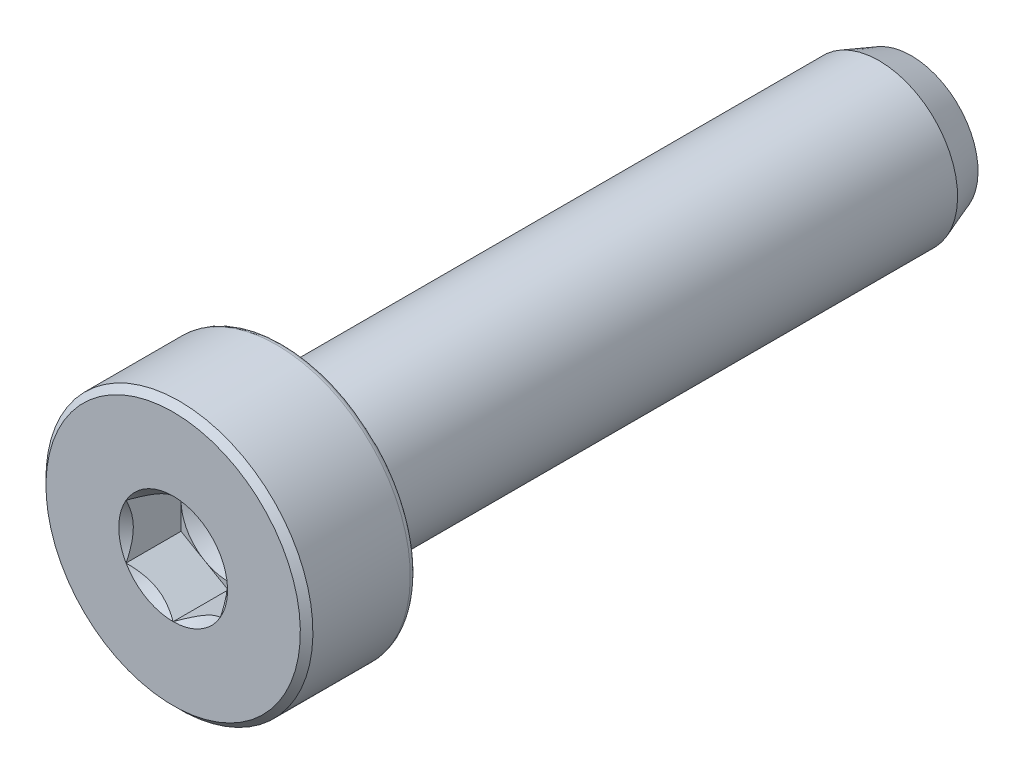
ISO-10303-21;
HEADER;
FILE_DESCRIPTION(('STEP AP214'),'2;1');
FILE_NAME('part.step','',(''),(''),'','','');
FILE_SCHEMA(('AUTOMOTIVE_DESIGN { 1 0 10303 214 1 1 1 1 }'));
ENDSEC;
DATA;
#1=APPLICATION_CONTEXT('core data for automotive mechanical design processes');
#2=APPLICATION_PROTOCOL_DEFINITION('international standard','automotive_design',2000,#1);
#3=PRODUCT_CONTEXT('',#1,'mechanical');
#4=PRODUCT('Part','Part','',(#3));
#5=PRODUCT_RELATED_PRODUCT_CATEGORY('part','',(#4));
#6=PRODUCT_DEFINITION_FORMATION('','',#4);
#7=PRODUCT_DEFINITION_CONTEXT('part definition',#1,'design');
#8=PRODUCT_DEFINITION('design','',#6,#7);
#9=PRODUCT_DEFINITION_SHAPE('','',#8);
#10=(LENGTH_UNIT() NAMED_UNIT(*) SI_UNIT(.MILLI.,.METRE.));
#11=(NAMED_UNIT(*) PLANE_ANGLE_UNIT() SI_UNIT($,.RADIAN.));
#12=(NAMED_UNIT(*) SI_UNIT($,.STERADIAN.) SOLID_ANGLE_UNIT());
#13=UNCERTAINTY_MEASURE_WITH_UNIT(LENGTH_MEASURE(1.E-05),#10,'distance_accuracy_value','');
#14=(GEOMETRIC_REPRESENTATION_CONTEXT(3) GLOBAL_UNCERTAINTY_ASSIGNED_CONTEXT((#13)) GLOBAL_UNIT_ASSIGNED_CONTEXT((#10,
#11,#12)) REPRESENTATION_CONTEXT('',''));
#15=CARTESIAN_POINT('',(0.,0.,0.));
#16=DIRECTION('',(0.,0.,1.));
#17=DIRECTION('',(1.,0.,0.));
#18=AXIS2_PLACEMENT_3D('',#15,#16,#17);
#19=CARTESIAN_POINT('',(-3.,0.,1.75));
#20=DIRECTION('',(0.,0.,-1.));
#21=DIRECTION('',(-1.,0.,0.));
#22=AXIS2_PLACEMENT_3D('',#19,#20,#21);
#23=PLANE('',#22);
#24=CARTESIAN_POINT('',(0.,0.,1.75));
#25=DIRECTION('',(0.,0.,1.));
#26=DIRECTION('',(1.,0.,0.));
#27=AXIS2_PLACEMENT_3D('',#24,#25,#26);
#28=CIRCLE('',#27,1.5);
#29=CARTESIAN_POINT('',(1.5,0.,1.75));
#30=VERTEX_POINT('',#29);
#31=CARTESIAN_POINT('',(0.750000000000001,1.29903810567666,1.75));
#32=VERTEX_POINT('',#31);
#33=EDGE_CURVE('E52',#30,#32,#28,.T.);
#34=ORIENTED_EDGE('',*,*,#33,.F.);
#35=DIRECTION('',(0.,1.,0.));
#36=VECTOR('',#35,1.);
#37=CARTESIAN_POINT('',(1.5,-0.866025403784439,1.75));
#38=LINE('',#37,#36);
#39=CARTESIAN_POINT('',(1.5,0.86602540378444,1.75));
#40=VERTEX_POINT('',#39);
#41=EDGE_CURVE('E122',#30,#40,#38,.T.);
#42=ORIENTED_EDGE('',*,*,#41,.T.);
#43=DIRECTION('',(-0.866025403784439,0.5,0.));
#44=VECTOR('',#43,1.);
#45=CARTESIAN_POINT('',(1.5,0.86602540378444,1.75));
#46=LINE('',#45,#44);
#47=EDGE_CURVE('E125',#40,#32,#46,.T.);
#48=ORIENTED_EDGE('',*,*,#47,.T.);
#49=EDGE_LOOP('',(#34,#42,#48));
#50=FACE_BOUND('',#49,.T.);
#51=ADVANCED_FACE('F36',(#50),#23,.F.);
#52=CARTESIAN_POINT('',(-0.750000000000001,1.29903810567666,1.75));
#53=VERTEX_POINT('',#52);
#54=EDGE_CURVE('E11',#32,#53,#28,.T.);
#55=ORIENTED_EDGE('',*,*,#54,.F.);
#56=CARTESIAN_POINT('',(0.,1.73205080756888,1.75));
#57=VERTEX_POINT('',#56);
#58=EDGE_CURVE('E139',#32,#57,#46,.T.);
#59=ORIENTED_EDGE('',*,*,#58,.T.);
#60=DIRECTION('',(-0.866025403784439,-0.5,0.));
#61=VECTOR('',#60,1.);
#62=CARTESIAN_POINT('',(0.,1.73205080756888,1.75));
#63=LINE('',#62,#61);
#64=EDGE_CURVE('E145',#57,#53,#63,.T.);
#65=ORIENTED_EDGE('',*,*,#64,.T.);
#66=EDGE_LOOP('',(#55,#59,#65));
#67=FACE_BOUND('',#66,.T.);
#68=ADVANCED_FACE('F299',(#67),#23,.F.);
#69=CARTESIAN_POINT('',(-1.5,0.,1.75));
#70=VERTEX_POINT('',#69);
#71=EDGE_CURVE('E50',#53,#70,#28,.T.);
#72=ORIENTED_EDGE('',*,*,#71,.F.);
#73=CARTESIAN_POINT('',(-1.5,0.866025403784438,1.75));
#74=VERTEX_POINT('',#73);
#75=EDGE_CURVE('E144',#53,#74,#63,.T.);
#76=ORIENTED_EDGE('',*,*,#75,.T.);
#77=DIRECTION('',(0.,-1.,0.));
#78=VECTOR('',#77,1.);
#79=CARTESIAN_POINT('',(-1.5,0.866025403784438,1.75));
#80=LINE('',#79,#78);
#81=EDGE_CURVE('E149',#74,#70,#80,.T.);
#82=ORIENTED_EDGE('',*,*,#81,.T.);
#83=EDGE_LOOP('',(#72,#76,#82));
#84=FACE_BOUND('',#83,.T.);
#85=ADVANCED_FACE('F303',(#84),#23,.F.);
#86=CARTESIAN_POINT('',(-0.750000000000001,-1.29903810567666,1.75));
#87=VERTEX_POINT('',#86);
#88=EDGE_CURVE('E320',#70,#87,#28,.T.);
#89=ORIENTED_EDGE('',*,*,#88,.F.);
#90=CARTESIAN_POINT('',(-1.5,-0.866025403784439,1.75));
#91=VERTEX_POINT('',#90);
#92=EDGE_CURVE('E148',#70,#91,#80,.T.);
#93=ORIENTED_EDGE('',*,*,#92,.T.);
#94=DIRECTION('',(0.866025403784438,-0.5,0.));
#95=VECTOR('',#94,1.);
#96=CARTESIAN_POINT('',(-1.5,-0.866025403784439,1.75));
#97=LINE('',#96,#95);
#98=EDGE_CURVE('E245',#91,#87,#97,.T.);
#99=ORIENTED_EDGE('',*,*,#98,.T.);
#100=EDGE_LOOP('',(#89,#93,#99));
#101=FACE_BOUND('',#100,.T.);
#102=ADVANCED_FACE('F314',(#101),#23,.F.);
#103=CARTESIAN_POINT('',(0.75,-1.29903810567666,1.75));
#104=VERTEX_POINT('',#103);
#105=EDGE_CURVE('E59',#87,#104,#28,.T.);
#106=ORIENTED_EDGE('',*,*,#105,.F.);
#107=CARTESIAN_POINT('',(0.,-1.73205080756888,1.75));
#108=VERTEX_POINT('',#107);
#109=EDGE_CURVE('E229',#87,#108,#97,.T.);
#110=ORIENTED_EDGE('',*,*,#109,.T.);
#111=DIRECTION('',(0.866025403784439,0.5,0.));
#112=VECTOR('',#111,1.);
#113=CARTESIAN_POINT('',(0.,-1.73205080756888,1.75));
#114=LINE('',#113,#112);
#115=EDGE_CURVE('E134',#108,#104,#114,.T.);
#116=ORIENTED_EDGE('',*,*,#115,.T.);
#117=EDGE_LOOP('',(#106,#110,#116));
#118=FACE_BOUND('',#117,.T.);
#119=ADVANCED_FACE('F307',(#118),#23,.F.);
#120=EDGE_CURVE('E112',#104,#30,#28,.T.);
#121=ORIENTED_EDGE('',*,*,#120,.F.);
#122=CARTESIAN_POINT('',(1.5,-0.866025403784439,1.75));
#123=VERTEX_POINT('',#122);
#124=EDGE_CURVE('E137',#104,#123,#114,.T.);
#125=ORIENTED_EDGE('',*,*,#124,.T.);
#126=EDGE_CURVE('E130',#123,#30,#38,.T.);
#127=ORIENTED_EDGE('',*,*,#126,.T.);
#128=EDGE_LOOP('',(#121,#125,#127));
#129=FACE_BOUND('',#128,.T.);
#130=ADVANCED_FACE('F136',(#129),#23,.F.);
#131=CARTESIAN_POINT('',(0.,0.,0.));
#132=DIRECTION('',(0.,0.,1.));
#133=DIRECTION('',(1.,0.,0.));
#134=AXIS2_PLACEMENT_3D('',#131,#132,#133);
#135=PLANE('',#134);
#136=CARTESIAN_POINT('',(0.,0.,0.));
#137=DIRECTION('',(0.,0.,1.));
#138=DIRECTION('',(1.,0.,0.));
#139=AXIS2_PLACEMENT_3D('',#136,#137,#138);
#140=CIRCLE('',#139,2.5);
#141=CARTESIAN_POINT('',(2.5,0.,0.));
#142=VERTEX_POINT('',#141);
#143=EDGE_CURVE('E179',#142,#142,#140,.F.);
#144=ORIENTED_EDGE('',*,*,#143,.F.);
#145=EDGE_LOOP('',(#144));
#146=FACE_BOUND('',#145,.T.);
#147=CARTESIAN_POINT('',(0.,0.,0.));
#148=DIRECTION('',(0.,0.,-1.));
#149=DIRECTION('',(0.,1.,0.));
#150=AXIS2_PLACEMENT_3D('',#147,#148,#149);
#151=CIRCLE('',#150,4.05);
#152=CARTESIAN_POINT('',(0.,4.05,0.));
#153=VERTEX_POINT('',#152);
#154=EDGE_CURVE('E176',#153,#153,#151,.T.);
#155=ORIENTED_EDGE('',*,*,#154,.T.);
#156=EDGE_LOOP('',(#155));
#157=FACE_BOUND('',#156,.T.);
#158=ADVANCED_FACE('F306',(#146,#157),#135,.F.);
#159=CARTESIAN_POINT('',(0.,0.,0.));
#160=DIRECTION('',(0.,0.,-1.));
#161=DIRECTION('',(0.,1.,0.));
#162=AXIS2_PLACEMENT_3D('',#159,#160,#161);
#163=CYLINDRICAL_SURFACE('',#162,2.5);
#164=CARTESIAN_POINT('',(0.,0.,-18.9771755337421));
#165=DIRECTION('',(0.,0.,-1.));
#166=DIRECTION('',(0.,1.,0.));
#167=AXIS2_PLACEMENT_3D('',#164,#165,#166);
#168=CIRCLE('',#167,2.5);
#169=CARTESIAN_POINT('',(0.,2.5,-18.9771755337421));
#170=VERTEX_POINT('',#169);
#171=EDGE_CURVE('E184',#170,#170,#168,.T.);
#172=ORIENTED_EDGE('',*,*,#171,.F.);
#173=EDGE_LOOP('',(#172));
#174=FACE_BOUND('',#173,.T.);
#175=ORIENTED_EDGE('',*,*,#143,.T.);
#176=EDGE_LOOP('',(#175));
#177=FACE_BOUND('',#176,.T.);
#178=ADVANCED_FACE('F38',(#174,#177),#163,.T.);
#179=CARTESIAN_POINT('',(0.,0.,-18.9771755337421));
#180=DIRECTION('',(0.,0.,1.));
#181=DIRECTION('',(0.,-1.,0.));
#182=AXIS2_PLACEMENT_3D('',#179,#180,#181);
#183=CONICAL_SURFACE('',#182,2.5,0.349065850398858);
#184=CARTESIAN_POINT('',(0.,0.,-20.));
#185=DIRECTION('',(0.,0.,-1.));
#186=DIRECTION('',(0.,1.,0.));
#187=AXIS2_PLACEMENT_3D('',#184,#185,#186);
#188=CIRCLE('',#187,2.12772233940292);
#189=CARTESIAN_POINT('',(0.,2.12772233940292,-20.));
#190=VERTEX_POINT('',#189);
#191=EDGE_CURVE('E182',#190,#190,#188,.T.);
#192=ORIENTED_EDGE('',*,*,#191,.F.);
#193=EDGE_LOOP('',(#192));
#194=FACE_BOUND('',#193,.T.);
#195=ORIENTED_EDGE('',*,*,#171,.T.);
#196=EDGE_LOOP('',(#195));
#197=FACE_BOUND('',#196,.T.);
#198=ADVANCED_FACE('F354',(#194,#197),#183,.T.);
#199=CARTESIAN_POINT('',(0.,0.,-20.));
#200=DIRECTION('',(0.,0.,-1.));
#201=DIRECTION('',(0.,1.,0.));
#202=AXIS2_PLACEMENT_3D('',#199,#200,#201);
#203=PLANE('',#202);
#204=ORIENTED_EDGE('',*,*,#191,.T.);
#205=EDGE_LOOP('',(#204));
#206=FACE_BOUND('',#205,.T.);
#207=ADVANCED_FACE('F356',(#206),#203,.T.);
#208=CARTESIAN_POINT('',(0.,0.,0.199999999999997));
#209=DIRECTION('',(0.,0.,-1.));
#210=DIRECTION('',(0.,1.,0.));
#211=AXIS2_PLACEMENT_3D('',#208,#209,#210);
#212=TOROIDAL_SURFACE('',#211,4.05,0.199999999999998);
#213=ORIENTED_EDGE('',*,*,#154,.F.);
#214=EDGE_LOOP('',(#213));
#215=FACE_BOUND('',#214,.T.);
#216=CARTESIAN_POINT('',(0.,0.,0.199999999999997));
#217=DIRECTION('',(0.,0.,-1.));
#218=DIRECTION('',(0.,1.,0.));
#219=AXIS2_PLACEMENT_3D('',#216,#217,#218);
#220=CIRCLE('',#219,4.25);
#221=CARTESIAN_POINT('',(0.,4.25,0.199999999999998));
#222=VERTEX_POINT('',#221);
#223=EDGE_CURVE('E173',#222,#222,#220,.T.);
#224=ORIENTED_EDGE('',*,*,#223,.T.);
#225=EDGE_LOOP('',(#224));
#226=FACE_BOUND('',#225,.T.);
#227=ADVANCED_FACE('F349',(#215,#226),#212,.T.);
#228=CARTESIAN_POINT('',(0.,0.,3.5));
#229=DIRECTION('',(0.,0.,-1.));
#230=DIRECTION('',(-1.,0.,0.));
#231=AXIS2_PLACEMENT_3D('',#228,#229,#230);
#232=CYLINDRICAL_SURFACE('',#231,4.25);
#233=CARTESIAN_POINT('',(0.,0.,3.3));
#234=DIRECTION('',(0.,0.,-1.));
#235=DIRECTION('',(0.,1.,0.));
#236=AXIS2_PLACEMENT_3D('',#233,#234,#235);
#237=CIRCLE('',#236,4.25);
#238=CARTESIAN_POINT('',(0.,4.25,3.3));
#239=VERTEX_POINT('',#238);
#240=EDGE_CURVE('E170',#239,#239,#237,.T.);
#241=ORIENTED_EDGE('',*,*,#240,.T.);
#242=EDGE_LOOP('',(#241));
#243=FACE_BOUND('',#242,.T.);
#244=ORIENTED_EDGE('',*,*,#223,.F.);
#245=EDGE_LOOP('',(#244));
#246=FACE_BOUND('',#245,.T.);
#247=ADVANCED_FACE('F346',(#243,#246),#232,.T.);
#248=CARTESIAN_POINT('',(0.,0.,3.5));
#249=DIRECTION('',(0.,0.,-1.));
#250=DIRECTION('',(0.,1.,0.));
#251=AXIS2_PLACEMENT_3D('',#248,#249,#250);
#252=CONICAL_SURFACE('',#251,4.05,0.785398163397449);
#253=ORIENTED_EDGE('',*,*,#240,.F.);
#254=EDGE_LOOP('',(#253));
#255=FACE_BOUND('',#254,.T.);
#256=CARTESIAN_POINT('',(0.,0.,3.5));
#257=DIRECTION('',(0.,0.,-1.));
#258=DIRECTION('',(0.,1.,0.));
#259=AXIS2_PLACEMENT_3D('',#256,#257,#258);
#260=CIRCLE('',#259,4.05);
#261=CARTESIAN_POINT('',(0.,4.05,3.5));
#262=VERTEX_POINT('',#261);
#263=EDGE_CURVE('E156',#262,#262,#260,.T.);
#264=ORIENTED_EDGE('',*,*,#263,.T.);
#265=EDGE_LOOP('',(#264));
#266=FACE_BOUND('',#265,.T.);
#267=ADVANCED_FACE('F341',(#255,#266),#252,.T.);
#268=CARTESIAN_POINT('',(0.,0.,3.5));
#269=DIRECTION('',(0.,0.,1.));
#270=DIRECTION('',(1.,0.,0.));
#271=AXIS2_PLACEMENT_3D('',#268,#269,#270);
#272=PLANE('',#271);
#273=CARTESIAN_POINT('',(0.,0.,3.5));
#274=DIRECTION('',(0.,0.,1.));
#275=DIRECTION('',(1.,0.,0.));
#276=AXIS2_PLACEMENT_3D('',#273,#274,#275);
#277=CIRCLE('',#276,1.73205080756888);
#278=CARTESIAN_POINT('',(1.5,0.866025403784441,3.5));
#279=VERTEX_POINT('',#278);
#280=CARTESIAN_POINT('',(0.,1.73205080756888,3.5));
#281=VERTEX_POINT('',#280);
#282=EDGE_CURVE('E212',#279,#281,#277,.T.);
#283=ORIENTED_EDGE('',*,*,#282,.F.);
#284=CARTESIAN_POINT('',(1.5,-0.866025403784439,3.5));
#285=VERTEX_POINT('',#284);
#286=EDGE_CURVE('E205',#285,#279,#277,.T.);
#287=ORIENTED_EDGE('',*,*,#286,.F.);
#288=CARTESIAN_POINT('',(0.,-1.73205080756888,3.5));
#289=VERTEX_POINT('',#288);
#290=EDGE_CURVE('E198',#289,#285,#277,.T.);
#291=ORIENTED_EDGE('',*,*,#290,.F.);
#292=CARTESIAN_POINT('',(-1.5,-0.866025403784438,3.5));
#293=VERTEX_POINT('',#292);
#294=EDGE_CURVE('E204',#293,#289,#277,.T.);
#295=ORIENTED_EDGE('',*,*,#294,.F.);
#296=CARTESIAN_POINT('',(-1.5,0.866025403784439,3.5));
#297=VERTEX_POINT('',#296);
#298=EDGE_CURVE('E66',#297,#293,#277,.T.);
#299=ORIENTED_EDGE('',*,*,#298,.F.);
#300=EDGE_CURVE('E220',#281,#297,#277,.T.);
#301=ORIENTED_EDGE('',*,*,#300,.F.);
#302=EDGE_LOOP('',(#283,#287,#291,#295,#299,#301));
#303=FACE_BOUND('',#302,.T.);
#304=ORIENTED_EDGE('',*,*,#263,.F.);
#305=EDGE_LOOP('',(#304));
#306=FACE_BOUND('',#305,.T.);
#307=ADVANCED_FACE('F215',(#303,#306),#272,.T.);
#308=CARTESIAN_POINT('',(0.,0.,3.5));
#309=DIRECTION('',(0.,0.,1.));
#310=DIRECTION('',(1.,0.,0.));
#311=AXIS2_PLACEMENT_3D('',#308,#309,#310);
#312=CONICAL_SURFACE('',#311,1.73205080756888,0.78539816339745);
#313=ORIENTED_EDGE('',*,*,#290,.T.);
#314=CARTESIAN_POINT('',(-0.000200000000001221,-1.73216627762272,3.50011548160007));
#315=CARTESIAN_POINT('',(0.0513677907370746,-1.70239359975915,3.47036547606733));
#316=CARTESIAN_POINT('',(0.1037979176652,-1.67212305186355,3.44236248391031));
#317=CARTESIAN_POINT('',(0.210709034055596,-1.61039789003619,3.39108923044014));
#318=CARTESIAN_POINT('',(0.26520019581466,-1.57893740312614,3.36784750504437));
#319=CARTESIAN_POINT('',(0.375079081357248,-1.51549879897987,3.32803372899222));
#320=CARTESIAN_POINT('',(0.430438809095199,-1.4835368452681,3.3113615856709));
#321=CARTESIAN_POINT('',(0.54237725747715,-1.41890915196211,3.2856744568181));
#322=CARTESIAN_POINT('',(0.598952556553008,-1.38624538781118,3.27664029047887));
#323=CARTESIAN_POINT('',(0.69645538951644,-1.32995210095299,3.26848908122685));
#324=CARTESIAN_POINT('',(0.737256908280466,-1.30639533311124,3.26728225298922));
#325=CARTESIAN_POINT('',(0.818787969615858,-1.25932335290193,3.26931405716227));
#326=CARTESIAN_POINT('',(0.85951749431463,-1.23580815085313,3.27255367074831));
#327=CARTESIAN_POINT('',(0.940584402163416,-1.18900414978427,3.28329198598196));
#328=CARTESIAN_POINT('',(0.980921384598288,-1.1657155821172,3.29079465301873));
#329=CARTESIAN_POINT('',(1.06091833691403,-1.11952932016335,3.30965161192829));
#330=CARTESIAN_POINT('',(1.10057800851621,-1.09663179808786,3.32100755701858));
#331=CARTESIAN_POINT('',(1.20216313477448,-1.03798159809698,3.35472164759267));
#332=CARTESIAN_POINT('',(1.26345855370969,-1.00259267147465,3.37962184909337));
#333=CARTESIAN_POINT('',(1.35358562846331,-0.950557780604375,3.42165665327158));
#334=CARTESIAN_POINT('',(1.38328513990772,-0.933410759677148,3.4364251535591));
#335=CARTESIAN_POINT('',(1.44213790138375,-0.899432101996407,3.46731056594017));
#336=CARTESIAN_POINT('',(1.47129140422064,-0.88260031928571,3.48342683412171));
#337=CARTESIAN_POINT('',(1.5002,-0.865909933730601,3.50011548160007));
#338=B_SPLINE_CURVE_WITH_KNOTS('',3,(#314,#315,#316,#317,#318,#319,#320,#321,#322,#323,#324,
#325,#326,#327,#328,#329,#330,#331,#332,#333,#334,#335,#336,#337),.UNSPECIFIED.,.F.,.F.,(4,2,2,
2,2,2,2,2,2,2,2,4),(0.,0.199829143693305,0.400822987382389,0.598623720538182,0.79592624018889,
0.937113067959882,1.07833105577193,1.21968061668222,1.36109089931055,1.58570969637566,
1.69770705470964,1.80965120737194),.UNSPECIFIED.);
#339=EDGE_CURVE('E40',#289,#285,#338,.T.);
#340=ORIENTED_EDGE('',*,*,#339,.F.);
#341=EDGE_LOOP('',(#313,#340));
#342=FACE_BOUND('',#341,.T.);
#343=ADVANCED_FACE('F200',(#342),#312,.F.);
#344=ORIENTED_EDGE('',*,*,#286,.T.);
#345=CARTESIAN_POINT('',(1.5,-1.72720812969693,4.05557851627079));
#346=CARTESIAN_POINT('',(1.5,-1.68515175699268,4.02382990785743));
#347=CARTESIAN_POINT('',(1.5,-1.64286104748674,3.99239259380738));
#348=CARTESIAN_POINT('',(1.5,-1.55771581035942,3.93026908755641));
#349=CARTESIAN_POINT('',(1.5,-1.51486114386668,3.8995830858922));
#350=CARTESIAN_POINT('',(1.5,-1.3846813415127,3.80840719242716));
#351=CARTESIAN_POINT('',(1.5,-1.29637976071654,3.74928834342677));
#352=CARTESIAN_POINT('',(1.5,-1.11121478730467,3.6332309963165));
#353=CARTESIAN_POINT('',(1.5,-1.01415038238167,3.57660955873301));
#354=CARTESIAN_POINT('',(1.5,-0.815173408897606,3.47303688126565));
#355=CARTESIAN_POINT('',(1.5,-0.713278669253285,3.42605304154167));
#356=CARTESIAN_POINT('',(1.5,-0.560333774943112,3.36857266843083));
#357=CARTESIAN_POINT('',(1.5,-0.511547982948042,3.35207538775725));
#358=CARTESIAN_POINT('',(1.5,-0.412798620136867,3.322997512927));
#359=CARTESIAN_POINT('',(1.5,-0.362834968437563,3.31041718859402));
#360=CARTESIAN_POINT('',(1.5,-0.262863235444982,3.29003619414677));
#361=CARTESIAN_POINT('',(1.5,-0.212872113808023,3.28215363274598));
#362=CARTESIAN_POINT('',(1.5,-0.112355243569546,3.271322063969));
#363=CARTESIAN_POINT('',(1.5,-0.0618295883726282,3.26837220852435));
#364=CARTESIAN_POINT('',(1.5,0.0374291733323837,3.26762485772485));
#365=CARTESIAN_POINT('',(1.5,0.0861609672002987,3.26964473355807));
#366=CARTESIAN_POINT('',(1.5,0.183206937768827,3.27832255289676));
#367=CARTESIAN_POINT('',(1.5,0.231521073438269,3.28498094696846));
#368=CARTESIAN_POINT('',(1.5,0.328199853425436,3.30268524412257));
#369=CARTESIAN_POINT('',(1.5,0.376550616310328,3.31380581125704));
#370=CARTESIAN_POINT('',(1.5,0.472195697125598,3.33984341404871));
#371=CARTESIAN_POINT('',(1.5,0.51949010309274,3.35476013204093));
#372=CARTESIAN_POINT('',(1.5,0.668391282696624,3.40733522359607));
#373=CARTESIAN_POINT('',(1.5,0.767878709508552,3.45098128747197));
#374=CARTESIAN_POINT('',(1.5,0.962179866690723,3.5480229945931));
#375=CARTESIAN_POINT('',(1.5,1.05697519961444,3.60145366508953));
#376=CARTESIAN_POINT('',(1.5,1.23814273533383,3.71168585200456));
#377=CARTESIAN_POINT('',(1.5,1.3246994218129,3.76818792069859));
#378=CARTESIAN_POINT('',(1.5,1.45222331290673,3.85553430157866));
#379=CARTESIAN_POINT('',(1.5,1.49418091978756,3.88495775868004));
#380=CARTESIAN_POINT('',(1.5,1.57752272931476,3.94458282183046));
#381=CARTESIAN_POINT('',(1.5,1.61890708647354,3.97478421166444));
#382=CARTESIAN_POINT('',(1.5,1.66005278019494,4.00530817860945));
#383=B_SPLINE_CURVE_WITH_KNOTS('',3,(#345,#346,#347,#348,#349,#350,#351,#352,#353,#354,#355,
#356,#357,#358,#359,#360,#361,#362,#363,#364,#365,#366,#367,#368,#369,#370,#371,#372,#373,#374,
#375,#376,#377,#378,#379,#380,#381,#382),.UNSPECIFIED.,.F.,.F.,(4,2,2,2,2,2,2,2,2,2,2,2,2,2,2,2,
2,2,4),(0.,0.158079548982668,0.316198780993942,0.634850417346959,0.971690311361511,
1.30737131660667,1.46173961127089,1.61611853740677,1.7677210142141,1.91929742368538,
2.065387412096,2.21149159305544,2.36014984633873,2.5087956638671,2.83376031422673,
3.15991186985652,3.46985601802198,3.62358896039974,3.7772796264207),.UNSPECIFIED.);
#384=EDGE_CURVE('E208',#285,#279,#383,.T.);
#385=ORIENTED_EDGE('',*,*,#384,.F.);
#386=EDGE_LOOP('',(#344,#385));
#387=FACE_BOUND('',#386,.T.);
#388=ADVANCED_FACE('F209',(#387),#312,.F.);
#389=ORIENTED_EDGE('',*,*,#282,.T.);
#390=CARTESIAN_POINT('',(1.5002,0.865909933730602,3.50011548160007));
#391=CARTESIAN_POINT('',(1.44863220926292,0.895682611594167,3.47036547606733));
#392=CARTESIAN_POINT('',(1.3962020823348,0.925953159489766,3.44236248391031));
#393=CARTESIAN_POINT('',(1.2892909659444,0.987678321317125,3.39108923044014));
#394=CARTESIAN_POINT('',(1.23479980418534,1.01913880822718,3.36784750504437));
#395=CARTESIAN_POINT('',(1.12492091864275,1.08257741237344,3.32803372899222));
#396=CARTESIAN_POINT('',(1.0695611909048,1.11453936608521,3.3113615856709));
#397=CARTESIAN_POINT('',(0.95762274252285,1.1791670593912,3.2856744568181));
#398=CARTESIAN_POINT('',(0.901047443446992,1.21183082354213,3.27664029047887));
#399=CARTESIAN_POINT('',(0.80354461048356,1.26812411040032,3.26848908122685));
#400=CARTESIAN_POINT('',(0.762743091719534,1.29168087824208,3.26728225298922));
#401=CARTESIAN_POINT('',(0.681212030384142,1.33875285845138,3.26931405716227));
#402=CARTESIAN_POINT('',(0.64048250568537,1.36226806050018,3.27255367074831));
#403=CARTESIAN_POINT('',(0.559415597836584,1.40907206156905,3.28329198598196));
#404=CARTESIAN_POINT('',(0.519078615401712,1.43236062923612,3.29079465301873));
#405=CARTESIAN_POINT('',(0.439081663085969,1.47854689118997,3.30965161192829));
#406=CARTESIAN_POINT('',(0.399421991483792,1.50144441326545,3.32100755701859));
#407=CARTESIAN_POINT('',(0.297836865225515,1.56009461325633,3.35472164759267));
#408=CARTESIAN_POINT('',(0.236541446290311,1.59548353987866,3.37962184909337));
#409=CARTESIAN_POINT('',(0.146414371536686,1.64751843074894,3.42165665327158));
#410=CARTESIAN_POINT('',(0.116714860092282,1.66466545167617,3.4364251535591));
#411=CARTESIAN_POINT('',(0.0578620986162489,1.69864410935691,3.46731056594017));
#412=CARTESIAN_POINT('',(0.0287085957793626,1.71547589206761,3.48342683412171));
#413=CARTESIAN_POINT('',(-0.000200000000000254,1.73216627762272,3.50011548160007));
#414=B_SPLINE_CURVE_WITH_KNOTS('',3,(#390,#391,#392,#393,#394,#395,#396,#397,#398,#399,#400,
#401,#402,#403,#404,#405,#406,#407,#408,#409,#410,#411,#412,#413),.UNSPECIFIED.,.F.,.F.,(4,2,2,
2,2,2,2,2,2,2,2,4),(0.,0.199829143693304,0.400822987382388,0.598623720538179,0.795926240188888,
0.93711306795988,1.07833105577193,1.21968061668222,1.36109089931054,1.58570969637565,
1.69770705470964,1.80965120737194),.UNSPECIFIED.);
#415=EDGE_CURVE('E211',#279,#281,#414,.T.);
#416=ORIENTED_EDGE('',*,*,#415,.F.);
#417=EDGE_LOOP('',(#389,#416));
#418=FACE_BOUND('',#417,.T.);
#419=ADVANCED_FACE('F329',(#418),#312,.F.);
#420=ORIENTED_EDGE('',*,*,#300,.T.);
#421=CARTESIAN_POINT('',(0.000200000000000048,1.73216627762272,3.50011548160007));
#422=CARTESIAN_POINT('',(-0.0513677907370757,1.70239359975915,3.47036547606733));
#423=CARTESIAN_POINT('',(-0.103797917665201,1.67212305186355,3.44236248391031));
#424=CARTESIAN_POINT('',(-0.210709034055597,1.61039789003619,3.39108923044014));
#425=CARTESIAN_POINT('',(-0.265200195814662,1.57893740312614,3.36784750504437));
#426=CARTESIAN_POINT('',(-0.375079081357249,1.51549879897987,3.32803372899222));
#427=CARTESIAN_POINT('',(-0.4304388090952,1.4835368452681,3.3113615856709));
#428=CARTESIAN_POINT('',(-0.542377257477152,1.41890915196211,3.2856744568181));
#429=CARTESIAN_POINT('',(-0.59895255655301,1.38624538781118,3.27664029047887));
#430=CARTESIAN_POINT('',(-0.696455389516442,1.32995210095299,3.26848908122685));
#431=CARTESIAN_POINT('',(-0.737256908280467,1.30639533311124,3.26728225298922));
#432=CARTESIAN_POINT('',(-0.818787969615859,1.25932335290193,3.26931405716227));
#433=CARTESIAN_POINT('',(-0.859517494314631,1.23580815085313,3.27255367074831));
#434=CARTESIAN_POINT('',(-0.940584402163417,1.18900414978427,3.28329198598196));
#435=CARTESIAN_POINT('',(-0.980921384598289,1.1657155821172,3.29079465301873));
#436=CARTESIAN_POINT('',(-1.06091833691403,1.11952932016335,3.30965161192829));
#437=CARTESIAN_POINT('',(-1.10057800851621,1.09663179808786,3.32100755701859));
#438=CARTESIAN_POINT('',(-1.20216313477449,1.03798159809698,3.35472164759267));
#439=CARTESIAN_POINT('',(-1.26345855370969,1.00259267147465,3.37962184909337));
#440=CARTESIAN_POINT('',(-1.35358562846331,0.950557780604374,3.42165665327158));
#441=CARTESIAN_POINT('',(-1.38328513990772,0.933410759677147,3.4364251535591));
#442=CARTESIAN_POINT('',(-1.44213790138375,0.899432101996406,3.46731056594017));
#443=CARTESIAN_POINT('',(-1.47129140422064,0.88260031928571,3.48342683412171));
#444=CARTESIAN_POINT('',(-1.5002,0.865909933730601,3.50011548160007));
#445=B_SPLINE_CURVE_WITH_KNOTS('',3,(#421,#422,#423,#424,#425,#426,#427,#428,#429,#430,#431,
#432,#433,#434,#435,#436,#437,#438,#439,#440,#441,#442,#443,#444),.UNSPECIFIED.,.F.,.F.,(4,2,2,
2,2,2,2,2,2,2,2,4),(0.,0.199829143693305,0.40082298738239,0.598623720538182,0.795926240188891,
0.937113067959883,1.07833105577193,1.21968061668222,1.36109089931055,1.58570969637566,
1.69770705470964,1.80965120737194),.UNSPECIFIED.);
#446=EDGE_CURVE('E240',#281,#297,#445,.T.);
#447=ORIENTED_EDGE('',*,*,#446,.F.);
#448=EDGE_LOOP('',(#420,#447));
#449=FACE_BOUND('',#448,.T.);
#450=ADVANCED_FACE('F327',(#449),#312,.F.);
#451=ORIENTED_EDGE('',*,*,#298,.T.);
#452=CARTESIAN_POINT('',(-1.5,-1.72720812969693,4.05557851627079));
#453=CARTESIAN_POINT('',(-1.5,-1.68515175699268,4.02382990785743));
#454=CARTESIAN_POINT('',(-1.5,-1.64286104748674,3.99239259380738));
#455=CARTESIAN_POINT('',(-1.5,-1.55771581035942,3.93026908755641));
#456=CARTESIAN_POINT('',(-1.5,-1.51486114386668,3.8995830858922));
#457=CARTESIAN_POINT('',(-1.5,-1.3846813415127,3.80840719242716));
#458=CARTESIAN_POINT('',(-1.5,-1.29637976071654,3.74928834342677));
#459=CARTESIAN_POINT('',(-1.5,-1.11121478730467,3.6332309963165));
#460=CARTESIAN_POINT('',(-1.5,-1.01415038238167,3.57660955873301));
#461=CARTESIAN_POINT('',(-1.5,-0.815173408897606,3.47303688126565));
#462=CARTESIAN_POINT('',(-1.5,-0.713278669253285,3.42605304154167));
#463=CARTESIAN_POINT('',(-1.5,-0.560333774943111,3.36857266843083));
#464=CARTESIAN_POINT('',(-1.5,-0.511547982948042,3.35207538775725));
#465=CARTESIAN_POINT('',(-1.5,-0.412798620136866,3.322997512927));
#466=CARTESIAN_POINT('',(-1.5,-0.362834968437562,3.31041718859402));
#467=CARTESIAN_POINT('',(-1.5,-0.262863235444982,3.29003619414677));
#468=CARTESIAN_POINT('',(-1.5,-0.212872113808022,3.28215363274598));
#469=CARTESIAN_POINT('',(-1.5,-0.112355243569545,3.271322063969));
#470=CARTESIAN_POINT('',(-1.5,-0.0618295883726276,3.26837220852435));
#471=CARTESIAN_POINT('',(-1.5,0.0374291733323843,3.26762485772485));
#472=CARTESIAN_POINT('',(-1.5,0.0861609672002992,3.26964473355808));
#473=CARTESIAN_POINT('',(-1.5,0.183206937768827,3.27832255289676));
#474=CARTESIAN_POINT('',(-1.5,0.231521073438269,3.28498094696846));
#475=CARTESIAN_POINT('',(-1.5,0.328199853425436,3.30268524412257));
#476=CARTESIAN_POINT('',(-1.5,0.376550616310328,3.31380581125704));
#477=CARTESIAN_POINT('',(-1.5,0.472195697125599,3.33984341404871));
#478=CARTESIAN_POINT('',(-1.5,0.519490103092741,3.35476013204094));
#479=CARTESIAN_POINT('',(-1.5,0.668391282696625,3.40733522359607));
#480=CARTESIAN_POINT('',(-1.5,0.767878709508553,3.45098128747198));
#481=CARTESIAN_POINT('',(-1.5,0.962179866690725,3.5480229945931));
#482=CARTESIAN_POINT('',(-1.5,1.05697519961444,3.60145366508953));
#483=CARTESIAN_POINT('',(-1.5,1.23814273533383,3.71168585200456));
#484=CARTESIAN_POINT('',(-1.5,1.3246994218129,3.7681879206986));
#485=CARTESIAN_POINT('',(-1.5,1.45222331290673,3.85553430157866));
#486=CARTESIAN_POINT('',(-1.5,1.49418091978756,3.88495775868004));
#487=CARTESIAN_POINT('',(-1.5,1.57752272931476,3.94458282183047));
#488=CARTESIAN_POINT('',(-1.5,1.61890708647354,3.97478421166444));
#489=CARTESIAN_POINT('',(-1.5,1.66005278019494,4.00530817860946));
#490=B_SPLINE_CURVE_WITH_KNOTS('',3,(#452,#453,#454,#455,#456,#457,#458,#459,#460,#461,#462,
#463,#464,#465,#466,#467,#468,#469,#470,#471,#472,#473,#474,#475,#476,#477,#478,#479,#480,#481,
#482,#483,#484,#485,#486,#487,#488,#489),.UNSPECIFIED.,.F.,.F.,(4,2,2,2,2,2,2,2,2,2,2,2,2,2,2,2,
2,2,4),(0.,0.158079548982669,0.316198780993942,0.634850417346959,0.971690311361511,
1.30737131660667,1.46173961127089,1.61611853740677,1.7677210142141,1.91929742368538,
2.065387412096,2.21149159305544,2.36014984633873,2.5087956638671,2.83376031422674,
3.15991186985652,3.46985601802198,3.62358896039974,3.77727962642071),.UNSPECIFIED.);
#491=EDGE_CURVE('E230',#297,#293,#490,.F.);
#492=ORIENTED_EDGE('',*,*,#491,.F.);
#493=EDGE_LOOP('',(#451,#492));
#494=FACE_BOUND('',#493,.T.);
#495=ADVANCED_FACE('F263',(#494),#312,.F.);
#496=ORIENTED_EDGE('',*,*,#294,.T.);
#497=CARTESIAN_POINT('',(-1.5002,-0.865909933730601,3.50011548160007));
#498=CARTESIAN_POINT('',(-1.44863220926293,-0.895682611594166,3.47036547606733));
#499=CARTESIAN_POINT('',(-1.3962020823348,-0.925953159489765,3.44236248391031));
#500=CARTESIAN_POINT('',(-1.2892909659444,-0.987678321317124,3.39108923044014));
#501=CARTESIAN_POINT('',(-1.23479980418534,-1.01913880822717,3.36784750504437));
#502=CARTESIAN_POINT('',(-1.12492091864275,-1.08257741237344,3.32803372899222));
#503=CARTESIAN_POINT('',(-1.0695611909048,-1.11453936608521,3.3113615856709));
#504=CARTESIAN_POINT('',(-0.957622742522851,-1.1791670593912,3.2856744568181));
#505=CARTESIAN_POINT('',(-0.901047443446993,-1.21183082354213,3.27664029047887));
#506=CARTESIAN_POINT('',(-0.80354461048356,-1.26812411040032,3.26848908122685));
#507=CARTESIAN_POINT('',(-0.762743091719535,-1.29168087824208,3.26728225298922));
#508=CARTESIAN_POINT('',(-0.681212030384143,-1.33875285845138,3.26931405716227));
#509=CARTESIAN_POINT('',(-0.640482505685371,-1.36226806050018,3.27255367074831));
#510=CARTESIAN_POINT('',(-0.559415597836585,-1.40907206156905,3.28329198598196));
#511=CARTESIAN_POINT('',(-0.519078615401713,-1.43236062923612,3.29079465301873));
#512=CARTESIAN_POINT('',(-0.43908166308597,-1.47854689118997,3.30965161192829));
#513=CARTESIAN_POINT('',(-0.399421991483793,-1.50144441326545,3.32100755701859));
#514=CARTESIAN_POINT('',(-0.297836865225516,-1.56009461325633,3.35472164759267));
#515=CARTESIAN_POINT('',(-0.236541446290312,-1.59548353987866,3.37962184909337));
#516=CARTESIAN_POINT('',(-0.146414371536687,-1.64751843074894,3.42165665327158));
#517=CARTESIAN_POINT('',(-0.116714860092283,-1.66466545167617,3.4364251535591));
#518=CARTESIAN_POINT('',(-0.0578620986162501,-1.69864410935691,3.46731056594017));
#519=CARTESIAN_POINT('',(-0.0287085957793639,-1.71547589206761,3.48342683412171));
#520=CARTESIAN_POINT('',(0.000199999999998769,-1.73216627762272,3.50011548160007));
#521=B_SPLINE_CURVE_WITH_KNOTS('',3,(#497,#498,#499,#500,#501,#502,#503,#504,#505,#506,#507,
#508,#509,#510,#511,#512,#513,#514,#515,#516,#517,#518,#519,#520),.UNSPECIFIED.,.F.,.F.,(4,2,2,
2,2,2,2,2,2,2,2,4),(0.,0.199829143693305,0.400822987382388,0.59862372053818,0.795926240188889,
0.937113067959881,1.07833105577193,1.21968061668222,1.36109089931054,1.58570969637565,
1.69770705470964,1.80965120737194),.UNSPECIFIED.);
#522=EDGE_CURVE('E226',#293,#289,#521,.T.);
#523=ORIENTED_EDGE('',*,*,#522,.F.);
#524=EDGE_LOOP('',(#496,#523));
#525=FACE_BOUND('',#524,.T.);
#526=ADVANCED_FACE('F225',(#525),#312,.F.);
#527=CARTESIAN_POINT('',(0.,-1.73205080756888,1.75));
#528=DIRECTION('',(0.5,-0.866025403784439,0.));
#529=DIRECTION('',(0.866025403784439,0.5,0.));
#530=AXIS2_PLACEMENT_3D('',#527,#528,#529);
#531=PLANE('',#530);
#532=DIRECTION('',(0.,0.,1.));
#533=VECTOR('',#532,1.);
#534=CARTESIAN_POINT('',(0.,-1.73205080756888,1.75));
#535=LINE('',#534,#533);
#536=EDGE_CURVE('E152',#108,#289,#535,.T.);
#537=ORIENTED_EDGE('',*,*,#536,.T.);
#538=ORIENTED_EDGE('',*,*,#339,.T.);
#539=DIRECTION('',(0.,0.,1.));
#540=VECTOR('',#539,1.);
#541=CARTESIAN_POINT('',(1.5,-0.866025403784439,1.75));
#542=LINE('',#541,#540);
#543=EDGE_CURVE('E164',#123,#285,#542,.T.);
#544=ORIENTED_EDGE('',*,*,#543,.F.);
#545=ORIENTED_EDGE('',*,*,#124,.F.);
#546=ORIENTED_EDGE('',*,*,#115,.F.);
#547=EDGE_LOOP('',(#537,#538,#544,#545,#546));
#548=FACE_BOUND('',#547,.T.);
#549=ADVANCED_FACE('F192',(#548),#531,.F.);
#550=CARTESIAN_POINT('',(1.5,-0.866025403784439,1.75));
#551=DIRECTION('',(1.,0.,0.));
#552=DIRECTION('',(0.,0.,-1.));
#553=AXIS2_PLACEMENT_3D('',#550,#551,#552);
#554=PLANE('',#553);
#555=ORIENTED_EDGE('',*,*,#543,.T.);
#556=ORIENTED_EDGE('',*,*,#384,.T.);
#557=DIRECTION('',(0.,0.,1.));
#558=VECTOR('',#557,1.);
#559=CARTESIAN_POINT('',(1.5,0.86602540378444,1.75));
#560=LINE('',#559,#558);
#561=EDGE_CURVE('E133',#40,#279,#560,.T.);
#562=ORIENTED_EDGE('',*,*,#561,.F.);
#563=ORIENTED_EDGE('',*,*,#41,.F.);
#564=ORIENTED_EDGE('',*,*,#126,.F.);
#565=EDGE_LOOP('',(#555,#556,#562,#563,#564));
#566=FACE_BOUND('',#565,.T.);
#567=ADVANCED_FACE('F129',(#566),#554,.F.);
#568=CARTESIAN_POINT('',(1.5,0.86602540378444,1.75));
#569=DIRECTION('',(0.5,0.866025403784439,0.));
#570=DIRECTION('',(-0.866025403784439,0.5,0.));
#571=AXIS2_PLACEMENT_3D('',#568,#569,#570);
#572=PLANE('',#571);
#573=ORIENTED_EDGE('',*,*,#561,.T.);
#574=ORIENTED_EDGE('',*,*,#415,.T.);
#575=DIRECTION('',(0.,0.,1.));
#576=VECTOR('',#575,1.);
#577=CARTESIAN_POINT('',(0.,1.73205080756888,1.75));
#578=LINE('',#577,#576);
#579=EDGE_CURVE('E160',#57,#281,#578,.T.);
#580=ORIENTED_EDGE('',*,*,#579,.F.);
#581=ORIENTED_EDGE('',*,*,#58,.F.);
#582=ORIENTED_EDGE('',*,*,#47,.F.);
#583=EDGE_LOOP('',(#573,#574,#580,#581,#582));
#584=FACE_BOUND('',#583,.T.);
#585=ADVANCED_FACE('F286',(#584),#572,.F.);
#586=CARTESIAN_POINT('',(0.,1.73205080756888,1.75));
#587=DIRECTION('',(-0.5,0.866025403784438,0.));
#588=DIRECTION('',(-0.866025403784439,-0.5,0.));
#589=AXIS2_PLACEMENT_3D('',#586,#587,#588);
#590=PLANE('',#589);
#591=ORIENTED_EDGE('',*,*,#579,.T.);
#592=ORIENTED_EDGE('',*,*,#446,.T.);
#593=DIRECTION('',(0.,0.,1.));
#594=VECTOR('',#593,1.);
#595=CARTESIAN_POINT('',(-1.5,0.866025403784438,1.75));
#596=LINE('',#595,#594);
#597=EDGE_CURVE('E157',#74,#297,#596,.T.);
#598=ORIENTED_EDGE('',*,*,#597,.F.);
#599=ORIENTED_EDGE('',*,*,#75,.F.);
#600=ORIENTED_EDGE('',*,*,#64,.F.);
#601=EDGE_LOOP('',(#591,#592,#598,#599,#600));
#602=FACE_BOUND('',#601,.T.);
#603=ADVANCED_FACE('F283',(#602),#590,.F.);
#604=CARTESIAN_POINT('',(-1.5,0.866025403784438,1.75));
#605=DIRECTION('',(-1.,0.,0.));
#606=DIRECTION('',(0.,0.,1.));
#607=AXIS2_PLACEMENT_3D('',#604,#605,#606);
#608=PLANE('',#607);
#609=ORIENTED_EDGE('',*,*,#597,.T.);
#610=ORIENTED_EDGE('',*,*,#491,.T.);
#611=DIRECTION('',(0.,0.,1.));
#612=VECTOR('',#611,1.);
#613=CARTESIAN_POINT('',(-1.5,-0.866025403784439,1.75));
#614=LINE('',#613,#612);
#615=EDGE_CURVE('E153',#91,#293,#614,.T.);
#616=ORIENTED_EDGE('',*,*,#615,.F.);
#617=ORIENTED_EDGE('',*,*,#92,.F.);
#618=ORIENTED_EDGE('',*,*,#81,.F.);
#619=EDGE_LOOP('',(#609,#610,#616,#617,#618));
#620=FACE_BOUND('',#619,.T.);
#621=ADVANCED_FACE('F234',(#620),#608,.F.);
#622=CARTESIAN_POINT('',(-1.5,-0.866025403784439,1.75));
#623=DIRECTION('',(-0.5,-0.866025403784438,0.));
#624=DIRECTION('',(0.866025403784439,-0.5,0.));
#625=AXIS2_PLACEMENT_3D('',#622,#623,#624);
#626=PLANE('',#625);
#627=ORIENTED_EDGE('',*,*,#615,.T.);
#628=ORIENTED_EDGE('',*,*,#522,.T.);
#629=ORIENTED_EDGE('',*,*,#536,.F.);
#630=ORIENTED_EDGE('',*,*,#109,.F.);
#631=ORIENTED_EDGE('',*,*,#98,.F.);
#632=EDGE_LOOP('',(#627,#628,#629,#630,#631));
#633=FACE_BOUND('',#632,.T.);
#634=ADVANCED_FACE('F242',(#633),#626,.F.);
#635=CARTESIAN_POINT('',(0.,0.,1.75));
#636=DIRECTION('',(0.,0.,1.));
#637=DIRECTION('',(1.,0.,0.));
#638=AXIS2_PLACEMENT_3D('',#635,#636,#637);
#639=CONICAL_SURFACE('',#638,1.5,1.0471975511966);
#640=CARTESIAN_POINT('',(0.,0.,1.16666666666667));
#641=DIRECTION('',(0.,0.,1.));
#642=DIRECTION('',(1.,0.,0.));
#643=AXIS2_PLACEMENT_3D('',#640,#641,#642);
#644=CIRCLE('',#643,0.48963702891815);
#645=CARTESIAN_POINT('',(0.48963702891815,0.,1.16666666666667));
#646=VERTEX_POINT('',#645);
#647=EDGE_CURVE('E126',#646,#646,#644,.T.);
#648=ORIENTED_EDGE('',*,*,#647,.F.);
#649=EDGE_LOOP('',(#648));
#650=FACE_BOUND('',#649,.T.);
#651=ORIENTED_EDGE('',*,*,#33,.T.);
#652=ORIENTED_EDGE('',*,*,#54,.T.);
#653=ORIENTED_EDGE('',*,*,#71,.T.);
#654=ORIENTED_EDGE('',*,*,#88,.T.);
#655=ORIENTED_EDGE('',*,*,#105,.T.);
#656=ORIENTED_EDGE('',*,*,#120,.T.);
#657=EDGE_LOOP('',(#651,#652,#653,#654,#655,#656));
#658=FACE_BOUND('',#657,.T.);
#659=ADVANCED_FACE('F114',(#650,#658),#639,.F.);
#660=CARTESIAN_POINT('',(0.,0.,1.16666666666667));
#661=DIRECTION('',(0.,0.,1.));
#662=DIRECTION('',(1.,0.,0.));
#663=AXIS2_PLACEMENT_3D('',#660,#661,#662);
#664=PLANE('',#663);
#665=ORIENTED_EDGE('',*,*,#647,.T.);
#666=EDGE_LOOP('',(#665));
#667=FACE_BOUND('',#666,.T.);
#668=ADVANCED_FACE('F494',(#667),#664,.T.);
#669=CLOSED_SHELL('',(#51,#68,#85,#102,#119,#130,#158,#178,#198,#207,#227,#247,#267,#307,#343,
#388,#419,#450,#495,#526,#549,#567,#585,#603,#621,#634,#659,#668));
#670=MANIFOLD_SOLID_BREP('B2',#669);
#671=ADVANCED_BREP_SHAPE_REPRESENTATION('',(#18,#670),#14);
#672=SHAPE_DEFINITION_REPRESENTATION(#9,#671);
ENDSEC;
END-ISO-10303-21;
